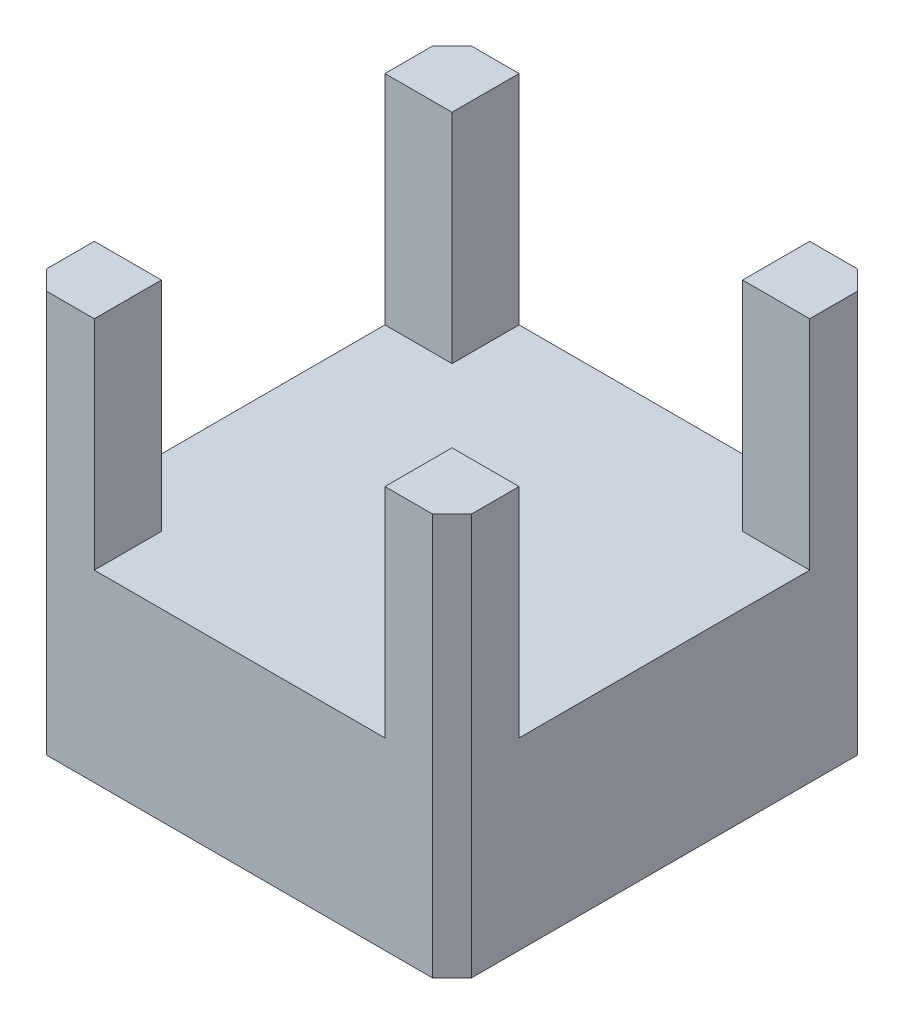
from build123d import *

# Parameters (mm, degrees)
BOSS_EXTRUDE1_DEPTH     = 41.38
CUT_EXTRUDE1_DEPTH      = 52.665613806
CUT_EXTRUDE1_DEPTH_BACK = 22.42


with BuildPart() as part:
    # Sketch2 → Boss-Extrude1 (new body)
    with BuildSketch(Plane(origin=(0, 0, 0), x_dir=(1, 0, 0), z_dir=(0, 1, 0))):
        Polygon((-21.875, 19.875), (-19.875, 21.875), (19.875, 21.875), (21.875, 19.875), (21.875, -19.875), (19.875, -21.875), (-19.875, -21.875), (-21.875, -19.875), align=None)
    extrude(amount=BOSS_EXTRUDE1_DEPTH)

    # Sketch3 → Cut-Extrude1 (cut, two sides: drawn at the far end of the back side and taken through both)
    with BuildSketch(Plane(origin=(0, 41.38, 0), x_dir=(1, 0, 0), z_dir=(0, 1, 0)).offset(-CUT_EXTRUDE1_DEPTH_BACK)):
        Polygon((-21.875, -14.965), (-21.875, 14.965), (-14.965, 14.965), (-14.965, 21.875), (14.965, 21.875), (14.965, 14.965), (21.875, 14.965), (21.875, -14.965), (14.965, -14.965), (14.965, -21.875), (-14.965, -21.875), (-14.965, -14.965), align=None)
    extrude(amount=CUT_EXTRUDE1_DEPTH + CUT_EXTRUDE1_DEPTH_BACK, mode=Mode.SUBTRACT)


solid = part.part
